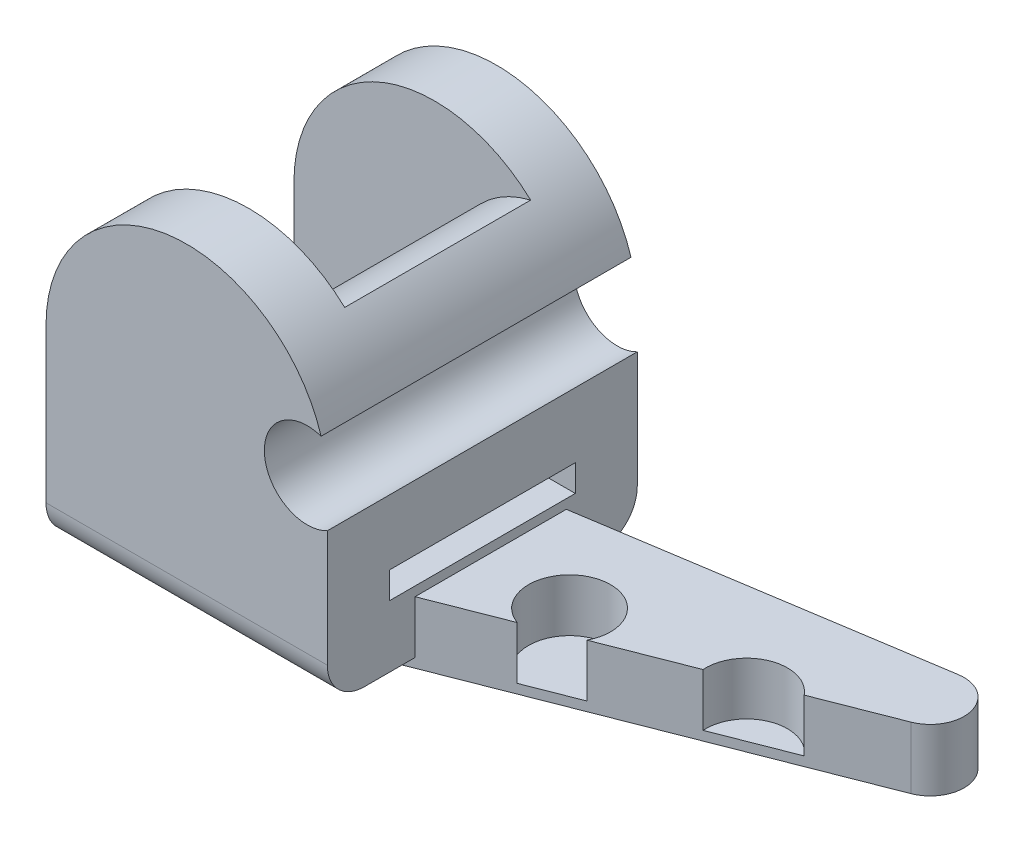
ISO-10303-21;
HEADER;
FILE_DESCRIPTION(('STEP AP214'),'2;1');
FILE_NAME('part.step','',(''),(''),'','','');
FILE_SCHEMA(('AUTOMOTIVE_DESIGN { 1 0 10303 214 1 1 1 1 }'));
ENDSEC;
DATA;
#1=APPLICATION_CONTEXT('core data for automotive mechanical design processes');
#2=APPLICATION_PROTOCOL_DEFINITION('international standard','automotive_design',2000,#1);
#3=PRODUCT_CONTEXT('',#1,'mechanical');
#4=PRODUCT('Part','Part','',(#3));
#5=PRODUCT_RELATED_PRODUCT_CATEGORY('part','',(#4));
#6=PRODUCT_DEFINITION_FORMATION('','',#4);
#7=PRODUCT_DEFINITION_CONTEXT('part definition',#1,'design');
#8=PRODUCT_DEFINITION('design','',#6,#7);
#9=PRODUCT_DEFINITION_SHAPE('','',#8);
#10=(LENGTH_UNIT() NAMED_UNIT(*) SI_UNIT(.MILLI.,.METRE.));
#11=(NAMED_UNIT(*) PLANE_ANGLE_UNIT() SI_UNIT($,.RADIAN.));
#12=(NAMED_UNIT(*) SI_UNIT($,.STERADIAN.) SOLID_ANGLE_UNIT());
#13=UNCERTAINTY_MEASURE_WITH_UNIT(LENGTH_MEASURE(1.E-05),#10,'distance_accuracy_value','');
#14=(GEOMETRIC_REPRESENTATION_CONTEXT(3) GLOBAL_UNCERTAINTY_ASSIGNED_CONTEXT((#13)) GLOBAL_UNIT_ASSIGNED_CONTEXT((#10,
#11,#12)) REPRESENTATION_CONTEXT('',''));
#15=CARTESIAN_POINT('',(0.,0.,0.));
#16=DIRECTION('',(0.,0.,1.));
#17=DIRECTION('',(1.,0.,0.));
#18=AXIS2_PLACEMENT_3D('',#15,#16,#17);
#19=CARTESIAN_POINT('',(45.3888439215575,-61.6059645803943,100.));
#20=DIRECTION('',(-1.,0.,0.));
#21=DIRECTION('',(0.,0.,1.));
#22=AXIS2_PLACEMENT_3D('',#19,#20,#21);
#23=PLANE('',#22);
#24=DIRECTION('',(0.,1.,0.));
#25=VECTOR('',#24,1.);
#26=CARTESIAN_POINT('',(45.3888439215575,-61.6059645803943,20.));
#27=LINE('',#26,#25);
#28=CARTESIAN_POINT('',(45.3888439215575,-41.6059645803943,20.));
#29=VERTEX_POINT('',#28);
#30=CARTESIAN_POINT('',(45.3888439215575,-33.0130206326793,20.));
#31=VERTEX_POINT('',#30);
#32=EDGE_CURVE('E241',#29,#31,#27,.T.);
#33=ORIENTED_EDGE('',*,*,#32,.F.);
#34=DIRECTION('',(0.,0.,-1.));
#35=VECTOR('',#34,1.);
#36=CARTESIAN_POINT('',(45.3888439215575,-41.6059645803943,100.));
#37=LINE('',#36,#35);
#38=CARTESIAN_POINT('',(45.3888439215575,-41.6059645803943,80.));
#39=VERTEX_POINT('',#38);
#40=EDGE_CURVE('E252',#39,#29,#37,.T.);
#41=ORIENTED_EDGE('',*,*,#40,.F.);
#42=DIRECTION('',(0.,1.,0.));
#43=VECTOR('',#42,1.);
#44=CARTESIAN_POINT('',(45.3888439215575,-61.6059645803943,80.));
#45=LINE('',#44,#43);
#46=CARTESIAN_POINT('',(45.3888439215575,-33.0130206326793,80.));
#47=VERTEX_POINT('',#46);
#48=EDGE_CURVE('E246',#39,#47,#45,.T.);
#49=ORIENTED_EDGE('',*,*,#48,.T.);
#50=DIRECTION('',(0.,0.,1.));
#51=VECTOR('',#50,1.);
#52=CARTESIAN_POINT('',(45.3888439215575,-33.0130206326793,20.));
#53=LINE('',#52,#51);
#54=EDGE_CURVE('E251',#31,#47,#53,.T.);
#55=ORIENTED_EDGE('',*,*,#54,.F.);
#56=EDGE_LOOP('',(#33,#41,#49,#55));
#57=FACE_BOUND('',#56,.T.);
#58=DIRECTION('',(0.,-1.,0.));
#59=VECTOR('',#58,1.);
#60=CARTESIAN_POINT('',(45.3888439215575,-61.6059645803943,71.7028936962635));
#61=LINE('',#60,#59);
#62=CARTESIAN_POINT('',(45.3888439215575,-44.6059645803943,71.7028936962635));
#63=VERTEX_POINT('',#62);
#64=CARTESIAN_POINT('',(45.3888439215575,-61.6059645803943,71.7028936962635));
#65=VERTEX_POINT('',#64);
#66=EDGE_CURVE('E236',#63,#65,#61,.T.);
#67=ORIENTED_EDGE('',*,*,#66,.F.);
#68=DIRECTION('',(0.,0.,1.));
#69=VECTOR('',#68,1.);
#70=CARTESIAN_POINT('',(45.3888439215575,-44.6059645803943,100.));
#71=LINE('',#70,#69);
#72=CARTESIAN_POINT('',(45.3888439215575,-44.6059645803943,22.8895611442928));
#73=VERTEX_POINT('',#72);
#74=EDGE_CURVE('E339',#73,#63,#71,.T.);
#75=ORIENTED_EDGE('',*,*,#74,.F.);
#76=DIRECTION('',(0.,-1.,0.));
#77=VECTOR('',#76,1.);
#78=CARTESIAN_POINT('',(45.3888439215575,-61.6059645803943,22.8895611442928));
#79=LINE('',#78,#77);
#80=CARTESIAN_POINT('',(45.3888439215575,-61.6059645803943,22.8895611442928));
#81=VERTEX_POINT('',#80);
#82=EDGE_CURVE('E233',#73,#81,#79,.T.);
#83=ORIENTED_EDGE('',*,*,#82,.T.);
#84=DIRECTION('',(0.,0.,-1.));
#85=VECTOR('',#84,1.);
#86=CARTESIAN_POINT('',(45.3888439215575,-61.6059645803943,100.));
#87=LINE('',#86,#85);
#88=CARTESIAN_POINT('',(45.3888439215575,-61.6059645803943,12.));
#89=VERTEX_POINT('',#88);
#90=EDGE_CURVE('E296',#81,#89,#87,.T.);
#91=ORIENTED_EDGE('',*,*,#90,.T.);
#92=CARTESIAN_POINT('',(45.3888439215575,-49.6059645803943,12.));
#93=DIRECTION('',(-1.,0.,0.));
#94=DIRECTION('',(0.,0.,1.));
#95=AXIS2_PLACEMENT_3D('',#92,#93,#94);
#96=CIRCLE('',#95,12.);
#97=CARTESIAN_POINT('',(45.3888439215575,-49.6059645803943,0.));
#98=VERTEX_POINT('',#97);
#99=EDGE_CURVE('E316',#89,#98,#96,.F.);
#100=ORIENTED_EDGE('',*,*,#99,.T.);
#101=DIRECTION('',(0.,1.,0.));
#102=VECTOR('',#101,1.);
#103=CARTESIAN_POINT('',(45.3888439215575,-61.6059645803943,0.));
#104=LINE('',#103,#102);
#105=CARTESIAN_POINT('',(45.3888439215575,-12.0369415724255,0.));
#106=VERTEX_POINT('',#105);
#107=EDGE_CURVE('E291',#98,#106,#104,.T.);
#108=ORIENTED_EDGE('',*,*,#107,.T.);
#109=DIRECTION('',(0.,0.,1.));
#110=VECTOR('',#109,1.);
#111=CARTESIAN_POINT('',(45.3888439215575,-12.0369415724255,0.));
#112=LINE('',#111,#110);
#113=CARTESIAN_POINT('',(45.3888439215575,-12.0369415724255,100.));
#114=VERTEX_POINT('',#113);
#115=EDGE_CURVE('E279',#106,#114,#112,.T.);
#116=ORIENTED_EDGE('',*,*,#115,.T.);
#117=DIRECTION('',(0.,1.,0.));
#118=VECTOR('',#117,1.);
#119=CARTESIAN_POINT('',(45.3888439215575,-61.6059645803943,100.));
#120=LINE('',#119,#118);
#121=CARTESIAN_POINT('',(45.3888439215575,-49.6059645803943,100.));
#122=VERTEX_POINT('',#121);
#123=EDGE_CURVE('E294',#122,#114,#120,.T.);
#124=ORIENTED_EDGE('',*,*,#123,.F.);
#125=CARTESIAN_POINT('',(45.3888439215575,-49.6059645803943,88.));
#126=DIRECTION('',(-1.,0.,0.));
#127=DIRECTION('',(0.,0.,1.));
#128=AXIS2_PLACEMENT_3D('',#125,#126,#127);
#129=CIRCLE('',#128,12.);
#130=CARTESIAN_POINT('',(45.3888439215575,-61.6059645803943,88.));
#131=VERTEX_POINT('',#130);
#132=EDGE_CURVE('E318',#122,#131,#129,.F.);
#133=ORIENTED_EDGE('',*,*,#132,.T.);
#134=EDGE_CURVE('E303',#131,#65,#87,.T.);
#135=ORIENTED_EDGE('',*,*,#134,.T.);
#136=EDGE_LOOP('',(#67,#75,#83,#91,#100,#108,#116,#124,#133,#135));
#137=FACE_BOUND('',#136,.T.);
#138=ADVANCED_FACE('F32',(#57,#137),#23,.F.);
#139=CARTESIAN_POINT('',(-45.3888439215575,-61.6059645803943,100.));
#140=DIRECTION('',(0.,1.,0.));
#141=DIRECTION('',(-1.,0.,0.));
#142=AXIS2_PLACEMENT_3D('',#139,#140,#141);
#143=PLANE('',#142);
#144=DIRECTION('',(-0.931386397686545,0.,0.364032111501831));
#145=VECTOR('',#144,1.);
#146=CARTESIAN_POINT('',(-42.9533040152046,-61.6059645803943,106.231397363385));
#147=LINE('',#146,#145);
#148=CARTESIAN_POINT('',(37.6343156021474,-61.6059645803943,74.733748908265));
#149=VERTEX_POINT('',#148);
#150=EDGE_CURVE('E337',#65,#149,#147,.T.);
#151=ORIENTED_EDGE('',*,*,#150,.F.);
#152=ORIENTED_EDGE('',*,*,#134,.F.);
#153=DIRECTION('',(1.,0.,0.));
#154=VECTOR('',#153,1.);
#155=CARTESIAN_POINT('',(-45.3888439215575,-61.6059645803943,88.));
#156=LINE('',#155,#154);
#157=CARTESIAN_POINT('',(-45.3888439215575,-61.6059645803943,88.));
#158=VERTEX_POINT('',#157);
#159=EDGE_CURVE('E323',#131,#158,#156,.F.);
#160=ORIENTED_EDGE('',*,*,#159,.T.);
#161=DIRECTION('',(0.,0.,-1.));
#162=VECTOR('',#161,1.);
#163=CARTESIAN_POINT('',(-45.3888439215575,-61.6059645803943,100.));
#164=LINE('',#163,#162);
#165=CARTESIAN_POINT('',(-45.3888439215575,-61.6059645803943,12.));
#166=VERTEX_POINT('',#165);
#167=EDGE_CURVE('E306',#158,#166,#164,.T.);
#168=ORIENTED_EDGE('',*,*,#167,.T.);
#169=DIRECTION('',(1.,0.,0.));
#170=VECTOR('',#169,1.);
#171=CARTESIAN_POINT('',(-45.3888439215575,-61.6059645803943,12.));
#172=LINE('',#171,#170);
#173=EDGE_CURVE('E320',#166,#89,#172,.T.);
#174=ORIENTED_EDGE('',*,*,#173,.T.);
#175=ORIENTED_EDGE('',*,*,#90,.F.);
#176=DIRECTION('',(-0.988059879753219,0.,0.15407035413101));
#177=VECTOR('',#176,1.);
#178=CARTESIAN_POINT('',(-54.9725715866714,-61.6059645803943,38.5391377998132));
#179=LINE('',#178,#177);
#180=CARTESIAN_POINT('',(24.5187965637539,-61.6059645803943,26.1438736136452));
#181=VERTEX_POINT('',#180);
#182=EDGE_CURVE('E331',#81,#181,#179,.T.);
#183=ORIENTED_EDGE('',*,*,#182,.T.);
#184=DIRECTION('',(-0.26059645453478,0.,-0.965447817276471));
#185=VECTOR('',#184,1.);
#186=CARTESIAN_POINT('',(38.3529639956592,-61.6059645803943,77.3961700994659));
#187=LINE('',#186,#185);
#188=EDGE_CURVE('E334',#149,#181,#187,.T.);
#189=ORIENTED_EDGE('',*,*,#188,.F.);
#190=EDGE_LOOP('',(#151,#152,#160,#168,#174,#175,#183,#189));
#191=FACE_BOUND('',#190,.T.);
#192=ADVANCED_FACE('F365',(#191),#143,.F.);
#193=CARTESIAN_POINT('',(-45.3888439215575,0.,100.));
#194=DIRECTION('',(1.,0.,0.));
#195=DIRECTION('',(0.,1.,0.));
#196=AXIS2_PLACEMENT_3D('',#193,#194,#195);
#197=PLANE('',#196);
#198=ORIENTED_EDGE('',*,*,#167,.F.);
#199=CARTESIAN_POINT('',(-45.3888439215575,-49.6059645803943,88.));
#200=DIRECTION('',(1.,0.,0.));
#201=DIRECTION('',(0.,1.,0.));
#202=AXIS2_PLACEMENT_3D('',#199,#200,#201);
#203=CIRCLE('',#202,12.);
#204=CARTESIAN_POINT('',(-45.3888439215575,-49.6059645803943,100.));
#205=VERTEX_POINT('',#204);
#206=EDGE_CURVE('E327',#158,#205,#203,.F.);
#207=ORIENTED_EDGE('',*,*,#206,.T.);
#208=DIRECTION('',(0.,-1.,0.));
#209=VECTOR('',#208,1.);
#210=CARTESIAN_POINT('',(-45.3888439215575,0.,100.));
#211=LINE('',#210,#209);
#212=CARTESIAN_POINT('',(-45.3888439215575,0.,100.));
#213=VERTEX_POINT('',#212);
#214=EDGE_CURVE('E290',#213,#205,#211,.T.);
#215=ORIENTED_EDGE('',*,*,#214,.F.);
#216=DIRECTION('',(0.,0.,-1.));
#217=VECTOR('',#216,1.);
#218=CARTESIAN_POINT('',(-45.3888439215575,0.,100.));
#219=LINE('',#218,#217);
#220=CARTESIAN_POINT('',(-45.3888439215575,0.,80.));
#221=VERTEX_POINT('',#220);
#222=EDGE_CURVE('E310',#213,#221,#219,.T.);
#223=ORIENTED_EDGE('',*,*,#222,.T.);
#224=DIRECTION('',(0.,-1.,0.));
#225=VECTOR('',#224,1.);
#226=CARTESIAN_POINT('',(-45.3888439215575,0.,80.));
#227=LINE('',#226,#225);
#228=CARTESIAN_POINT('',(-45.3888439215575,-41.6059645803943,80.));
#229=VERTEX_POINT('',#228);
#230=EDGE_CURVE('E247',#221,#229,#227,.T.);
#231=ORIENTED_EDGE('',*,*,#230,.T.);
#232=DIRECTION('',(0.,0.,-1.));
#233=VECTOR('',#232,1.);
#234=CARTESIAN_POINT('',(-45.3888439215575,-41.6059645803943,100.));
#235=LINE('',#234,#233);
#236=CARTESIAN_POINT('',(-45.3888439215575,-41.6059645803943,20.));
#237=VERTEX_POINT('',#236);
#238=EDGE_CURVE('E255',#229,#237,#235,.T.);
#239=ORIENTED_EDGE('',*,*,#238,.T.);
#240=DIRECTION('',(0.,-1.,0.));
#241=VECTOR('',#240,1.);
#242=CARTESIAN_POINT('',(-45.3888439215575,0.,20.));
#243=LINE('',#242,#241);
#244=CARTESIAN_POINT('',(-45.3888439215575,0.,20.));
#245=VERTEX_POINT('',#244);
#246=EDGE_CURVE('E242',#245,#237,#243,.T.);
#247=ORIENTED_EDGE('',*,*,#246,.F.);
#248=CARTESIAN_POINT('',(-45.3888439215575,0.,0.));
#249=VERTEX_POINT('',#248);
#250=EDGE_CURVE('E309',#245,#249,#219,.T.);
#251=ORIENTED_EDGE('',*,*,#250,.T.);
#252=DIRECTION('',(0.,-1.,0.));
#253=VECTOR('',#252,1.);
#254=CARTESIAN_POINT('',(-45.3888439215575,0.,0.));
#255=LINE('',#254,#253);
#256=CARTESIAN_POINT('',(-45.3888439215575,-49.6059645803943,0.));
#257=VERTEX_POINT('',#256);
#258=EDGE_CURVE('E299',#249,#257,#255,.T.);
#259=ORIENTED_EDGE('',*,*,#258,.T.);
#260=CARTESIAN_POINT('',(-45.3888439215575,-49.6059645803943,12.));
#261=DIRECTION('',(1.,0.,0.));
#262=DIRECTION('',(0.,1.,0.));
#263=AXIS2_PLACEMENT_3D('',#260,#261,#262);
#264=CIRCLE('',#263,12.);
#265=EDGE_CURVE('E325',#257,#166,#264,.F.);
#266=ORIENTED_EDGE('',*,*,#265,.T.);
#267=EDGE_LOOP('',(#198,#207,#215,#223,#231,#239,#247,#251,#259,#266));
#268=FACE_BOUND('',#267,.T.);
#269=ADVANCED_FACE('F371',(#268),#197,.F.);
#270=CARTESIAN_POINT('',(0.,0.,100.));
#271=DIRECTION('',(0.,0.,-1.));
#272=DIRECTION('',(-1.,0.,0.));
#273=AXIS2_PLACEMENT_3D('',#270,#271,#272);
#274=CYLINDRICAL_SURFACE('',#273,45.3888439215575);
#275=DIRECTION('',(0.,0.,1.));
#276=VECTOR('',#275,1.);
#277=CARTESIAN_POINT('',(30.9895329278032,33.163172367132,80.));
#278=LINE('',#277,#276);
#279=CARTESIAN_POINT('',(30.9895329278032,33.163172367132,80.));
#280=VERTEX_POINT('',#279);
#281=CARTESIAN_POINT('',(30.9895329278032,33.163172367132,20.));
#282=VERTEX_POINT('',#281);
#283=EDGE_CURVE('E261',#280,#282,#278,.F.);
#284=ORIENTED_EDGE('',*,*,#283,.F.);
#285=CARTESIAN_POINT('',(0.,0.,80.));
#286=DIRECTION('',(0.,0.,1.));
#287=DIRECTION('',(1.,0.,0.));
#288=AXIS2_PLACEMENT_3D('',#285,#286,#287);
#289=CIRCLE('',#288,45.3888439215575);
#290=EDGE_CURVE('E258',#280,#221,#289,.T.);
#291=ORIENTED_EDGE('',*,*,#290,.T.);
#292=ORIENTED_EDGE('',*,*,#222,.F.);
#293=CARTESIAN_POINT('',(0.,0.,100.));
#294=DIRECTION('',(0.,0.,1.));
#295=DIRECTION('',(1.,0.,0.));
#296=AXIS2_PLACEMENT_3D('',#293,#294,#295);
#297=CIRCLE('',#296,45.3888439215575);
#298=CARTESIAN_POINT('',(43.3743168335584,13.3722022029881,100.));
#299=VERTEX_POINT('',#298);
#300=EDGE_CURVE('E288',#299,#213,#297,.T.);
#301=ORIENTED_EDGE('',*,*,#300,.F.);
#302=DIRECTION('',(0.,0.,1.));
#303=VECTOR('',#302,1.);
#304=CARTESIAN_POINT('',(43.3743168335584,13.3722022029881,50.));
#305=LINE('',#304,#303);
#306=CARTESIAN_POINT('',(43.3743168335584,13.3722022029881,0.));
#307=VERTEX_POINT('',#306);
#308=EDGE_CURVE('E284',#299,#307,#305,.F.);
#309=ORIENTED_EDGE('',*,*,#308,.T.);
#310=CARTESIAN_POINT('',(0.,0.,0.));
#311=DIRECTION('',(0.,0.,1.));
#312=DIRECTION('',(1.,0.,0.));
#313=AXIS2_PLACEMENT_3D('',#310,#311,#312);
#314=CIRCLE('',#313,45.3888439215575);
#315=EDGE_CURVE('E287',#307,#249,#314,.T.);
#316=ORIENTED_EDGE('',*,*,#315,.T.);
#317=ORIENTED_EDGE('',*,*,#250,.F.);
#318=CARTESIAN_POINT('',(0.,0.,20.));
#319=DIRECTION('',(0.,0.,1.));
#320=DIRECTION('',(1.,0.,0.));
#321=AXIS2_PLACEMENT_3D('',#318,#319,#320);
#322=CIRCLE('',#321,45.3888439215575);
#323=EDGE_CURVE('E273',#282,#245,#322,.T.);
#324=ORIENTED_EDGE('',*,*,#323,.F.);
#325=EDGE_LOOP('',(#284,#291,#292,#301,#309,#316,#317,#324));
#326=FACE_BOUND('',#325,.T.);
#327=ADVANCED_FACE('F382',(#326),#274,.T.);
#328=CARTESIAN_POINT('',(0.,0.,100.));
#329=DIRECTION('',(0.,0.,1.));
#330=DIRECTION('',(1.,0.,0.));
#331=AXIS2_PLACEMENT_3D('',#328,#329,#330);
#332=PLANE('',#331);
#333=ORIENTED_EDGE('',*,*,#214,.T.);
#334=DIRECTION('',(1.,0.,0.));
#335=VECTOR('',#334,1.);
#336=CARTESIAN_POINT('',(45.3888439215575,-49.6059645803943,100.));
#337=LINE('',#336,#335);
#338=EDGE_CURVE('E313',#205,#122,#337,.T.);
#339=ORIENTED_EDGE('',*,*,#338,.T.);
#340=ORIENTED_EDGE('',*,*,#123,.T.);
#341=CARTESIAN_POINT('',(38.9237837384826,0.234916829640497,100.));
#342=DIRECTION('',(0.,0.,1.));
#343=DIRECTION('',(1.,0.,0.));
#344=AXIS2_PLACEMENT_3D('',#341,#342,#343);
#345=CIRCLE('',#344,13.8706709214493);
#346=EDGE_CURVE('E266',#299,#114,#345,.T.);
#347=ORIENTED_EDGE('',*,*,#346,.F.);
#348=ORIENTED_EDGE('',*,*,#300,.T.);
#349=EDGE_LOOP('',(#333,#339,#340,#347,#348));
#350=FACE_BOUND('',#349,.T.);
#351=ADVANCED_FACE('F385',(#350),#332,.T.);
#352=CARTESIAN_POINT('',(0.,0.,0.));
#353=DIRECTION('',(0.,0.,1.));
#354=DIRECTION('',(1.,0.,0.));
#355=AXIS2_PLACEMENT_3D('',#352,#353,#354);
#356=PLANE('',#355);
#357=ORIENTED_EDGE('',*,*,#107,.F.);
#358=DIRECTION('',(1.,0.,0.));
#359=VECTOR('',#358,1.);
#360=CARTESIAN_POINT('',(0.,-49.6059645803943,0.));
#361=LINE('',#360,#359);
#362=EDGE_CURVE('E329',#98,#257,#361,.F.);
#363=ORIENTED_EDGE('',*,*,#362,.T.);
#364=ORIENTED_EDGE('',*,*,#258,.F.);
#365=ORIENTED_EDGE('',*,*,#315,.F.);
#366=CARTESIAN_POINT('',(38.9237837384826,0.234916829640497,0.));
#367=DIRECTION('',(0.,0.,1.));
#368=DIRECTION('',(1.,0.,0.));
#369=AXIS2_PLACEMENT_3D('',#366,#367,#368);
#370=CIRCLE('',#369,13.8706709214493);
#371=EDGE_CURVE('E276',#307,#106,#370,.T.);
#372=ORIENTED_EDGE('',*,*,#371,.T.);
#373=EDGE_LOOP('',(#357,#363,#364,#365,#372));
#374=FACE_BOUND('',#373,.T.);
#375=ADVANCED_FACE('F377',(#374),#356,.F.);
#376=CARTESIAN_POINT('',(38.9237837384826,0.234916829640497,0.));
#377=DIRECTION('',(0.,0.,1.));
#378=DIRECTION('',(1.,0.,0.));
#379=AXIS2_PLACEMENT_3D('',#376,#377,#378);
#380=CYLINDRICAL_SURFACE('',#379,13.8706709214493);
#381=ORIENTED_EDGE('',*,*,#346,.T.);
#382=ORIENTED_EDGE('',*,*,#115,.F.);
#383=ORIENTED_EDGE('',*,*,#371,.F.);
#384=ORIENTED_EDGE('',*,*,#308,.F.);
#385=EDGE_LOOP('',(#381,#382,#383,#384));
#386=FACE_BOUND('',#385,.T.);
#387=ADVANCED_FACE('F439',(#386),#380,.F.);
#388=CARTESIAN_POINT('',(-45.3888439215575,-41.6059645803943,100.));
#389=DIRECTION('',(0.,1.,0.));
#390=DIRECTION('',(-1.,0.,0.));
#391=AXIS2_PLACEMENT_3D('',#388,#389,#390);
#392=PLANE('',#391);
#393=DIRECTION('',(1.,0.,0.));
#394=VECTOR('',#393,1.);
#395=CARTESIAN_POINT('',(-45.3888439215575,-41.6059645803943,20.));
#396=LINE('',#395,#394);
#397=EDGE_CURVE('E239',#237,#29,#396,.T.);
#398=ORIENTED_EDGE('',*,*,#397,.F.);
#399=ORIENTED_EDGE('',*,*,#238,.F.);
#400=DIRECTION('',(1.,0.,0.));
#401=VECTOR('',#400,1.);
#402=CARTESIAN_POINT('',(-45.3888439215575,-41.6059645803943,80.));
#403=LINE('',#402,#401);
#404=EDGE_CURVE('E243',#229,#39,#403,.T.);
#405=ORIENTED_EDGE('',*,*,#404,.T.);
#406=ORIENTED_EDGE('',*,*,#40,.T.);
#407=EDGE_LOOP('',(#398,#399,#405,#406));
#408=FACE_BOUND('',#407,.T.);
#409=ADVANCED_FACE('F419',(#408),#392,.T.);
#410=CARTESIAN_POINT('',(0.,0.,80.));
#411=DIRECTION('',(0.,0.,1.));
#412=DIRECTION('',(1.,0.,0.));
#413=AXIS2_PLACEMENT_3D('',#410,#411,#412);
#414=PLANE('',#413);
#415=CARTESIAN_POINT('',(38.9237837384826,0.234916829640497,80.));
#416=DIRECTION('',(0.,0.,1.));
#417=DIRECTION('',(1.,0.,0.));
#418=AXIS2_PLACEMENT_3D('',#415,#416,#417);
#419=CIRCLE('',#418,33.8706709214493);
#420=EDGE_CURVE('E238',#280,#47,#419,.T.);
#421=ORIENTED_EDGE('',*,*,#420,.T.);
#422=ORIENTED_EDGE('',*,*,#48,.F.);
#423=ORIENTED_EDGE('',*,*,#404,.F.);
#424=ORIENTED_EDGE('',*,*,#230,.F.);
#425=ORIENTED_EDGE('',*,*,#290,.F.);
#426=EDGE_LOOP('',(#421,#422,#423,#424,#425));
#427=FACE_BOUND('',#426,.T.);
#428=ADVANCED_FACE('F415',(#427),#414,.F.);
#429=CARTESIAN_POINT('',(0.,0.,20.));
#430=DIRECTION('',(0.,0.,1.));
#431=DIRECTION('',(1.,0.,0.));
#432=AXIS2_PLACEMENT_3D('',#429,#430,#431);
#433=PLANE('',#432);
#434=ORIENTED_EDGE('',*,*,#323,.T.);
#435=ORIENTED_EDGE('',*,*,#246,.T.);
#436=ORIENTED_EDGE('',*,*,#397,.T.);
#437=ORIENTED_EDGE('',*,*,#32,.T.);
#438=CARTESIAN_POINT('',(38.9237837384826,0.234916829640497,20.));
#439=DIRECTION('',(0.,0.,1.));
#440=DIRECTION('',(1.,0.,0.));
#441=AXIS2_PLACEMENT_3D('',#438,#439,#440);
#442=CIRCLE('',#441,33.8706709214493);
#443=EDGE_CURVE('E249',#282,#31,#442,.T.);
#444=ORIENTED_EDGE('',*,*,#443,.F.);
#445=EDGE_LOOP('',(#434,#435,#436,#437,#444));
#446=FACE_BOUND('',#445,.T.);
#447=ADVANCED_FACE('F396',(#446),#433,.T.);
#448=CARTESIAN_POINT('',(38.9237837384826,0.234916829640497,0.));
#449=DIRECTION('',(0.,0.,1.));
#450=DIRECTION('',(1.,0.,0.));
#451=AXIS2_PLACEMENT_3D('',#448,#449,#450);
#452=CYLINDRICAL_SURFACE('',#451,33.8706709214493);
#453=ORIENTED_EDGE('',*,*,#420,.F.);
#454=ORIENTED_EDGE('',*,*,#283,.T.);
#455=ORIENTED_EDGE('',*,*,#443,.T.);
#456=ORIENTED_EDGE('',*,*,#54,.T.);
#457=EDGE_LOOP('',(#453,#454,#455,#456));
#458=FACE_BOUND('',#457,.T.);
#459=ADVANCED_FACE('F389',(#458),#452,.T.);
#460=CARTESIAN_POINT('',(0.,-49.6059645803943,88.));
#461=DIRECTION('',(-1.,0.,0.));
#462=DIRECTION('',(0.,-1.,0.));
#463=AXIS2_PLACEMENT_3D('',#460,#461,#462);
#464=CYLINDRICAL_SURFACE('',#463,12.);
#465=ORIENTED_EDGE('',*,*,#206,.F.);
#466=ORIENTED_EDGE('',*,*,#159,.F.);
#467=ORIENTED_EDGE('',*,*,#132,.F.);
#468=ORIENTED_EDGE('',*,*,#338,.F.);
#469=EDGE_LOOP('',(#465,#466,#467,#468));
#470=FACE_BOUND('',#469,.T.);
#471=ADVANCED_FACE('F387',(#470),#464,.T.);
#472=CARTESIAN_POINT('',(-45.3888439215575,-49.6059645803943,12.));
#473=DIRECTION('',(1.,0.,0.));
#474=DIRECTION('',(0.,1.,0.));
#475=AXIS2_PLACEMENT_3D('',#472,#473,#474);
#476=CYLINDRICAL_SURFACE('',#475,12.);
#477=ORIENTED_EDGE('',*,*,#265,.F.);
#478=ORIENTED_EDGE('',*,*,#362,.F.);
#479=ORIENTED_EDGE('',*,*,#99,.F.);
#480=ORIENTED_EDGE('',*,*,#173,.F.);
#481=EDGE_LOOP('',(#477,#478,#479,#480));
#482=FACE_BOUND('',#481,.T.);
#483=ADVANCED_FACE('F34',(#482),#476,.T.);
#484=CARTESIAN_POINT('',(156.521207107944,-44.6059645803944,16.5784298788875));
#485=DIRECTION('',(0.,-1.,0.));
#486=DIRECTION('',(1.,0.,0.));
#487=AXIS2_PLACEMENT_3D('',#484,#485,#486);
#488=PLANE('',#487);
#489=DIRECTION('',(0.931386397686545,0.,-0.364032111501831));
#490=VECTOR('',#489,1.);
#491=CARTESIAN_POINT('',(37.6343156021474,-44.6059645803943,74.733748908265));
#492=LINE('',#491,#490);
#493=CARTESIAN_POINT('',(85.2646363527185,-44.6059645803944,56.1174514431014));
#494=VERTEX_POINT('',#493);
#495=CARTESIAN_POINT('',(112.197543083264,-44.6059645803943,45.5907324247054));
#496=VERTEX_POINT('',#495);
#497=EDGE_CURVE('E199',#494,#496,#492,.T.);
#498=ORIENTED_EDGE('',*,*,#497,.T.);
#499=CARTESIAN_POINT('',(125.389042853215,-44.6059645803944,44.7268437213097));
#500=DIRECTION('',(0.,-1.,0.));
#501=DIRECTION('',(1.,0.,0.));
#502=AXIS2_PLACEMENT_3D('',#499,#500,#501);
#503=CIRCLE('',#502,13.2197568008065);
#504=CARTESIAN_POINT('',(135.670094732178,-44.6059645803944,36.4164922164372));
#505=VERTEX_POINT('',#504);
#506=EDGE_CURVE('E188',#496,#505,#503,.T.);
#507=ORIENTED_EDGE('',*,*,#506,.T.);
#508=CARTESIAN_POINT('',(160.484216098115,-44.6059645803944,26.7178998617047));
#509=VERTEX_POINT('',#508);
#510=EDGE_CURVE('E193',#505,#509,#492,.T.);
#511=ORIENTED_EDGE('',*,*,#510,.T.);
#512=CARTESIAN_POINT('',(156.521207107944,-44.6059645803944,16.5784298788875));
#513=DIRECTION('',(0.,-1.,0.));
#514=DIRECTION('',(1.,0.,0.));
#515=AXIS2_PLACEMENT_3D('',#512,#513,#514);
#516=CIRCLE('',#515,10.8864269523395);
#517=CARTESIAN_POINT('',(154.843931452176,-44.6059645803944,5.82198817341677));
#518=VERTEX_POINT('',#517);
#519=EDGE_CURVE('E210',#518,#509,#516,.T.);
#520=ORIENTED_EDGE('',*,*,#519,.F.);
#521=DIRECTION('',(0.988059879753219,0.,-0.15407035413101));
#522=VECTOR('',#521,1.);
#523=CARTESIAN_POINT('',(24.5187965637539,-44.6059645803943,26.1438736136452));
#524=LINE('',#523,#522);
#525=EDGE_CURVE('E213',#73,#518,#524,.T.);
#526=ORIENTED_EDGE('',*,*,#525,.F.);
#527=ORIENTED_EDGE('',*,*,#74,.T.);
#528=CARTESIAN_POINT('',(69.0806440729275,-44.6059645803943,62.4429602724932));
#529=VERTEX_POINT('',#528);
#530=EDGE_CURVE('E202',#63,#529,#492,.T.);
#531=ORIENTED_EDGE('',*,*,#530,.T.);
#532=CARTESIAN_POINT('',(73.5454743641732,-44.6059645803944,50.));
#533=DIRECTION('',(0.,-1.,0.));
#534=DIRECTION('',(1.,0.,0.));
#535=AXIS2_PLACEMENT_3D('',#532,#533,#534);
#536=CIRCLE('',#535,13.2197568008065);
#537=EDGE_CURVE('E223',#529,#494,#536,.T.);
#538=ORIENTED_EDGE('',*,*,#537,.T.);
#539=EDGE_LOOP('',(#498,#507,#511,#520,#526,#527,#531,#538));
#540=FACE_BOUND('',#539,.T.);
#541=ADVANCED_FACE('F349',(#540),#488,.F.);
#542=CARTESIAN_POINT('',(24.5187965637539,-44.6059645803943,26.1438736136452));
#543=DIRECTION('',(0.965447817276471,0.,-0.26059645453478));
#544=DIRECTION('',(-0.26059645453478,0.,-0.965447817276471));
#545=AXIS2_PLACEMENT_3D('',#542,#543,#544);
#546=PLANE('',#545);
#547=DIRECTION('',(0.,-1.,0.));
#548=VECTOR('',#547,1.);
#549=CARTESIAN_POINT('',(37.6343156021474,-44.6059645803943,74.733748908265));
#550=LINE('',#549,#548);
#551=CARTESIAN_POINT('',(37.6343156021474,-64.6059645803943,74.733748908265));
#552=VERTEX_POINT('',#551);
#553=EDGE_CURVE('E231',#149,#552,#550,.T.);
#554=ORIENTED_EDGE('',*,*,#553,.F.);
#555=ORIENTED_EDGE('',*,*,#188,.T.);
#556=DIRECTION('',(0.,-1.,0.));
#557=VECTOR('',#556,1.);
#558=CARTESIAN_POINT('',(24.5187965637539,-44.6059645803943,26.1438736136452));
#559=LINE('',#558,#557);
#560=CARTESIAN_POINT('',(24.5187965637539,-64.6059645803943,26.1438736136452));
#561=VERTEX_POINT('',#560);
#562=EDGE_CURVE('E216',#181,#561,#559,.T.);
#563=ORIENTED_EDGE('',*,*,#562,.T.);
#564=DIRECTION('',(0.26059645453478,0.,0.965447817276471));
#565=VECTOR('',#564,1.);
#566=CARTESIAN_POINT('',(24.5187965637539,-64.6059645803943,26.1438736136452));
#567=LINE('',#566,#565);
#568=EDGE_CURVE('E219',#561,#552,#567,.T.);
#569=ORIENTED_EDGE('',*,*,#568,.T.);
#570=EDGE_LOOP('',(#554,#555,#563,#569));
#571=FACE_BOUND('',#570,.T.);
#572=ADVANCED_FACE('F446',(#571),#546,.F.);
#573=CARTESIAN_POINT('',(37.6343156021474,-44.6059645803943,74.733748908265));
#574=DIRECTION('',(-0.364032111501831,0.,-0.931386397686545));
#575=DIRECTION('',(-0.931386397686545,0.,0.364032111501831));
#576=AXIS2_PLACEMENT_3D('',#573,#574,#575);
#577=PLANE('',#576);
#578=ORIENTED_EDGE('',*,*,#510,.F.);
#579=DIRECTION('',(0.,-1.,0.));
#580=VECTOR('',#579,1.);
#581=CARTESIAN_POINT('',(135.670094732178,45.3888439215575,36.4164922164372));
#582=LINE('',#581,#580);
#583=CARTESIAN_POINT('',(135.670094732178,-61.6059645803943,36.4164922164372));
#584=VERTEX_POINT('',#583);
#585=EDGE_CURVE('E11',#505,#584,#582,.T.);
#586=ORIENTED_EDGE('',*,*,#585,.T.);
#587=DIRECTION('',(-0.931386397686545,0.,0.364032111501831));
#588=VECTOR('',#587,1.);
#589=CARTESIAN_POINT('',(37.6343156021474,-61.6059645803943,74.733748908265));
#590=LINE('',#589,#588);
#591=CARTESIAN_POINT('',(112.197543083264,-61.6059645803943,45.5907324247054));
#592=VERTEX_POINT('',#591);
#593=EDGE_CURVE('E179',#584,#592,#590,.T.);
#594=ORIENTED_EDGE('',*,*,#593,.T.);
#595=DIRECTION('',(0.,-1.,0.));
#596=VECTOR('',#595,1.);
#597=CARTESIAN_POINT('',(112.197543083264,45.3888439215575,45.5907324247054));
#598=LINE('',#597,#596);
#599=EDGE_CURVE('E40',#592,#496,#598,.F.);
#600=ORIENTED_EDGE('',*,*,#599,.T.);
#601=ORIENTED_EDGE('',*,*,#497,.F.);
#602=DIRECTION('',(0.,-1.,0.));
#603=VECTOR('',#602,1.);
#604=CARTESIAN_POINT('',(85.2646363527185,45.3888439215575,56.1174514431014));
#605=LINE('',#604,#603);
#606=CARTESIAN_POINT('',(85.2646363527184,-61.6059645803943,56.1174514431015));
#607=VERTEX_POINT('',#606);
#608=EDGE_CURVE('E183',#494,#607,#605,.T.);
#609=ORIENTED_EDGE('',*,*,#608,.T.);
#610=DIRECTION('',(-0.931386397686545,0.,0.364032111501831));
#611=VECTOR('',#610,1.);
#612=CARTESIAN_POINT('',(37.6343156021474,-61.6059645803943,74.733748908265));
#613=LINE('',#612,#611);
#614=CARTESIAN_POINT('',(69.0806440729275,-61.6059645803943,62.4429602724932));
#615=VERTEX_POINT('',#614);
#616=EDGE_CURVE('E341',#607,#615,#613,.T.);
#617=ORIENTED_EDGE('',*,*,#616,.T.);
#618=DIRECTION('',(0.,-1.,0.));
#619=VECTOR('',#618,1.);
#620=CARTESIAN_POINT('',(69.0806440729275,45.3888439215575,62.4429602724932));
#621=LINE('',#620,#619);
#622=EDGE_CURVE('E344',#615,#529,#621,.F.);
#623=ORIENTED_EDGE('',*,*,#622,.T.);
#624=ORIENTED_EDGE('',*,*,#530,.F.);
#625=ORIENTED_EDGE('',*,*,#66,.T.);
#626=ORIENTED_EDGE('',*,*,#150,.T.);
#627=ORIENTED_EDGE('',*,*,#553,.T.);
#628=DIRECTION('',(0.931386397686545,0.,-0.364032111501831));
#629=VECTOR('',#628,1.);
#630=CARTESIAN_POINT('',(37.6343156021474,-64.6059645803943,74.733748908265));
#631=LINE('',#630,#629);
#632=CARTESIAN_POINT('',(160.484216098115,-64.6059645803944,26.7178998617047));
#633=VERTEX_POINT('',#632);
#634=EDGE_CURVE('E222',#552,#633,#631,.T.);
#635=ORIENTED_EDGE('',*,*,#634,.T.);
#636=DIRECTION('',(0.,-1.,0.));
#637=VECTOR('',#636,1.);
#638=CARTESIAN_POINT('',(160.484216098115,-44.6059645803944,26.7178998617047));
#639=LINE('',#638,#637);
#640=EDGE_CURVE('E195',#509,#633,#639,.T.);
#641=ORIENTED_EDGE('',*,*,#640,.F.);
#642=EDGE_LOOP('',(#578,#586,#594,#600,#601,#609,#617,#623,#624,#625,#626,#627,#635,#641));
#643=FACE_BOUND('',#642,.T.);
#644=ADVANCED_FACE('F191',(#643),#577,.F.);
#645=CARTESIAN_POINT('',(24.5187965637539,-44.6059645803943,26.1438736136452));
#646=DIRECTION('',(-0.15407035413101,0.,-0.988059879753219));
#647=DIRECTION('',(-0.988059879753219,0.,0.15407035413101));
#648=AXIS2_PLACEMENT_3D('',#645,#646,#647);
#649=PLANE('',#648);
#650=ORIENTED_EDGE('',*,*,#82,.F.);
#651=ORIENTED_EDGE('',*,*,#525,.T.);
#652=DIRECTION('',(0.,-1.,0.));
#653=VECTOR('',#652,1.);
#654=CARTESIAN_POINT('',(154.843931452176,-44.6059645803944,5.82198817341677));
#655=LINE('',#654,#653);
#656=CARTESIAN_POINT('',(154.843931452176,-64.6059645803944,5.82198817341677));
#657=VERTEX_POINT('',#656);
#658=EDGE_CURVE('E228',#518,#657,#655,.T.);
#659=ORIENTED_EDGE('',*,*,#658,.T.);
#660=DIRECTION('',(0.988059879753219,0.,-0.15407035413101));
#661=VECTOR('',#660,1.);
#662=CARTESIAN_POINT('',(24.5187965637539,-64.6059645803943,26.1438736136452));
#663=LINE('',#662,#661);
#664=EDGE_CURVE('E200',#561,#657,#663,.T.);
#665=ORIENTED_EDGE('',*,*,#664,.F.);
#666=ORIENTED_EDGE('',*,*,#562,.F.);
#667=ORIENTED_EDGE('',*,*,#182,.F.);
#668=EDGE_LOOP('',(#650,#651,#659,#665,#666,#667));
#669=FACE_BOUND('',#668,.T.);
#670=ADVANCED_FACE('F442',(#669),#649,.T.);
#671=CARTESIAN_POINT('',(156.521207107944,-44.6059645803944,16.5784298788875));
#672=DIRECTION('',(0.,-1.,0.));
#673=DIRECTION('',(1.,0.,0.));
#674=AXIS2_PLACEMENT_3D('',#671,#672,#673);
#675=CYLINDRICAL_SURFACE('',#674,10.8864269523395);
#676=CARTESIAN_POINT('',(156.521207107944,-64.6059645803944,16.5784298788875));
#677=DIRECTION('',(0.,-1.,0.));
#678=DIRECTION('',(1.,0.,0.));
#679=AXIS2_PLACEMENT_3D('',#676,#677,#678);
#680=CIRCLE('',#679,10.8864269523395);
#681=EDGE_CURVE('E205',#657,#633,#680,.T.);
#682=ORIENTED_EDGE('',*,*,#681,.F.);
#683=ORIENTED_EDGE('',*,*,#658,.F.);
#684=ORIENTED_EDGE('',*,*,#519,.T.);
#685=ORIENTED_EDGE('',*,*,#640,.T.);
#686=EDGE_LOOP('',(#682,#683,#684,#685));
#687=FACE_BOUND('',#686,.T.);
#688=ADVANCED_FACE('F451',(#687),#675,.T.);
#689=CARTESIAN_POINT('',(156.521207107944,-64.6059645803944,16.5784298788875));
#690=DIRECTION('',(0.,-1.,0.));
#691=DIRECTION('',(1.,0.,0.));
#692=AXIS2_PLACEMENT_3D('',#689,#690,#691);
#693=PLANE('',#692);
#694=ORIENTED_EDGE('',*,*,#568,.F.);
#695=ORIENTED_EDGE('',*,*,#664,.T.);
#696=ORIENTED_EDGE('',*,*,#681,.T.);
#697=ORIENTED_EDGE('',*,*,#634,.F.);
#698=EDGE_LOOP('',(#694,#695,#696,#697));
#699=FACE_BOUND('',#698,.T.);
#700=ADVANCED_FACE('F362',(#699),#693,.T.);
#701=CARTESIAN_POINT('',(73.5454743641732,45.3888439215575,50.));
#702=DIRECTION('',(0.,-1.,0.));
#703=DIRECTION('',(1.,0.,0.));
#704=AXIS2_PLACEMENT_3D('',#701,#702,#703);
#705=CYLINDRICAL_SURFACE('',#704,13.2197568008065);
#706=ORIENTED_EDGE('',*,*,#537,.F.);
#707=ORIENTED_EDGE('',*,*,#622,.F.);
#708=CARTESIAN_POINT('',(73.5454743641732,-61.6059645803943,50.));
#709=DIRECTION('',(0.,-1.,0.));
#710=DIRECTION('',(1.,0.,0.));
#711=AXIS2_PLACEMENT_3D('',#708,#709,#710);
#712=CIRCLE('',#711,13.2197568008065);
#713=EDGE_CURVE('E53',#615,#607,#712,.T.);
#714=ORIENTED_EDGE('',*,*,#713,.T.);
#715=ORIENTED_EDGE('',*,*,#608,.F.);
#716=EDGE_LOOP('',(#706,#707,#714,#715));
#717=FACE_BOUND('',#716,.T.);
#718=ADVANCED_FACE('F353',(#717),#705,.F.);
#719=CARTESIAN_POINT('',(73.5454743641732,-61.6059645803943,50.));
#720=DIRECTION('',(0.,-1.,0.));
#721=DIRECTION('',(1.,0.,0.));
#722=AXIS2_PLACEMENT_3D('',#719,#720,#721);
#723=PLANE('',#722);
#724=ORIENTED_EDGE('',*,*,#713,.F.);
#725=ORIENTED_EDGE('',*,*,#616,.F.);
#726=EDGE_LOOP('',(#724,#725));
#727=FACE_BOUND('',#726,.T.);
#728=ADVANCED_FACE('F354',(#727),#723,.F.);
#729=CARTESIAN_POINT('',(125.389042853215,45.3888439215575,44.7268437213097));
#730=DIRECTION('',(0.,-1.,0.));
#731=DIRECTION('',(1.,0.,0.));
#732=AXIS2_PLACEMENT_3D('',#729,#730,#731);
#733=CYLINDRICAL_SURFACE('',#732,13.2197568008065);
#734=ORIENTED_EDGE('',*,*,#506,.F.);
#735=ORIENTED_EDGE('',*,*,#599,.F.);
#736=CARTESIAN_POINT('',(125.389042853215,-61.6059645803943,44.7268437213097));
#737=DIRECTION('',(0.,-1.,0.));
#738=DIRECTION('',(1.,0.,0.));
#739=AXIS2_PLACEMENT_3D('',#736,#737,#738);
#740=CIRCLE('',#739,13.2197568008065);
#741=EDGE_CURVE('E46',#592,#584,#740,.T.);
#742=ORIENTED_EDGE('',*,*,#741,.T.);
#743=ORIENTED_EDGE('',*,*,#585,.F.);
#744=EDGE_LOOP('',(#734,#735,#742,#743));
#745=FACE_BOUND('',#744,.T.);
#746=ADVANCED_FACE('F186',(#745),#733,.F.);
#747=CARTESIAN_POINT('',(125.389042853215,-61.6059645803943,44.7268437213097));
#748=DIRECTION('',(0.,-1.,0.));
#749=DIRECTION('',(1.,0.,0.));
#750=AXIS2_PLACEMENT_3D('',#747,#748,#749);
#751=PLANE('',#750);
#752=ORIENTED_EDGE('',*,*,#741,.F.);
#753=ORIENTED_EDGE('',*,*,#593,.F.);
#754=EDGE_LOOP('',(#752,#753));
#755=FACE_BOUND('',#754,.T.);
#756=ADVANCED_FACE('F180',(#755),#751,.F.);
#757=CLOSED_SHELL('',(#138,#192,#269,#327,#351,#375,#387,#409,#428,#447,#459,#471,#483,#541,
#572,#644,#670,#688,#700,#718,#728,#746,#756));
#758=MANIFOLD_SOLID_BREP('B2',#757);
#759=ADVANCED_BREP_SHAPE_REPRESENTATION('',(#18,#758),#14);
#760=SHAPE_DEFINITION_REPRESENTATION(#9,#759);
ENDSEC;
END-ISO-10303-21;
